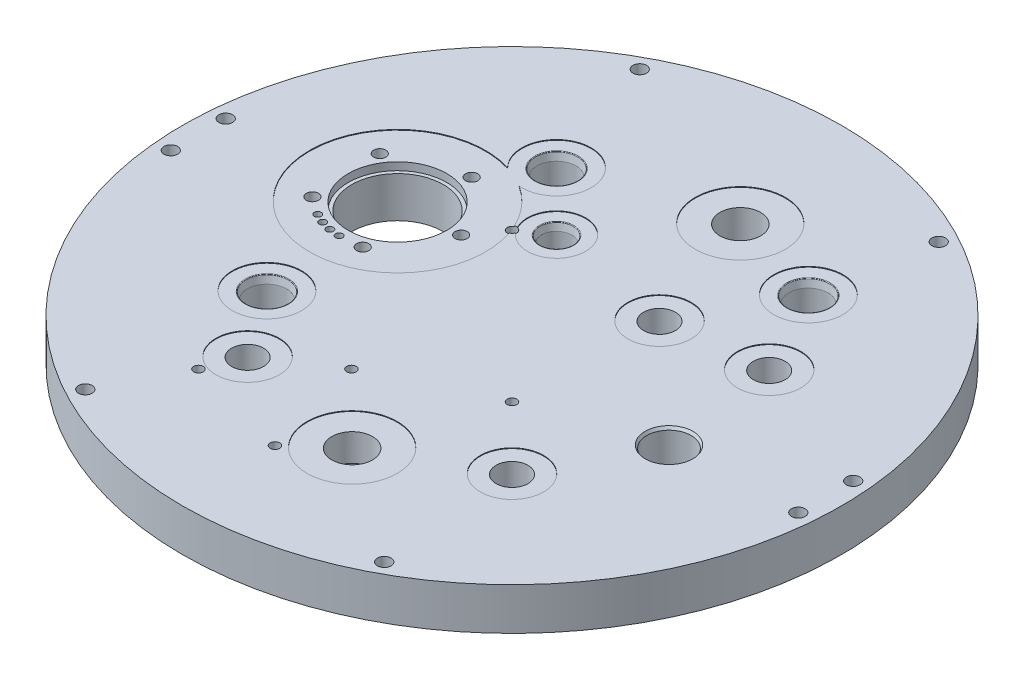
from build123d import *

# Parameters (mm, degrees)
CTD_PORT_D                                       = 33.02
CTD_PORT_CBORE_D                                 = 35.56
CTD_PORT_CBORE_DEPTH                             = 3.048
F_38_0_1015_DIAMETER_HOLE1_D                     = 2.54
F_17_0_173_DIAMETER_HOLE1_D                      = 4.3942
HOLE1_D                                          = 20
HOLE1_CBORE_D                                    = 63.5
HOLE1_CBORE_DEPTH                                = 0.254
F_8_32_TAPPED_HOLE2_D                            = 3.4544
F_8_32_TAPPED_HOLE2_DEPTH                        = 8.89
F_8_32_TAPPED_HOLE2_TIP                          = 1.037806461
F_4_40_TAPPED_HOLE1_D                            = 2.2606
F_4_40_TAPPED_HOLE1_DEPTH                        = 8.382
F_4_40_TAPPED_HOLE1_TIP                          = 0.679152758
F_4_40_TAPPED_HOLE2_D                            = 2.2606
F_4_40_TAPPED_HOLE2_DEPTH                        = 8.382
F_4_40_TAPPED_HOLE2_TIP                          = 0.679152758
F_8_32_TAPPED_HOLE3_D                            = 3.4544
F_8_32_TAPPED_HOLE3_DEPTH                        = 8.89
F_8_32_TAPPED_HOLE3_TIP                          = 1.037806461
THREAD_FOR_ANTENNA_PORT_D                        = 14.68374
ANTENNA_PORT_D                                   = 6.7564
ANTENNA_PORT_CBORE_D                             = 32.512
ANTENNA_PORT_CBORE_DEPTH                         = 0.254
CBORE_FOR_1_4_SOCKET_HEAD_CAP_SCREW2_D           = 6.7564
CBORE_FOR_1_4_SOCKET_HEAD_CAP_SCREW2_CBORE_D     = 28.575
CBORE_FOR_1_4_SOCKET_HEAD_CAP_SCREW2_CBORE_DEPTH = 7.62
SUBCONN_CBORES_D                                 = 11.50874
SUBCONN_CBORES_CBORE_D                           = 26.67
SUBCONN_CBORES_CBORE_DEPTH                       = 9.144
SUBCONN_PORTS_D                                  = 2.54
SUBCONN_PORTS_DEPTH                              = 25.4
SUBCONN_PORTS_CBORE_D                            = 22.86
SUBCONN_PORTS_CBORE_DEPTH                        = 0.254
F_8_32_TAPPED_HOLE5_D                            = 3.4544
F_8_32_TAPPED_HOLE5_DEPTH                        = 10.668
F_8_32_TAPPED_HOLE4_D                            = 3.4544
F_8_32_TAPPED_HOLE4_DEPTH                        = 10.668
F_10_0_1935_DIAMETER_HOLE1_D                     = 4.9149


with BuildPart() as part:
    # Sketch1 → Revolve1 (revolve)
    with BuildSketch(Plane.XY, mode=Mode.PRIVATE) as revolve1_sk:
        Polygon((0, 15.24), (-118.9355, 15.24), (-118.9355, 0), (-91.821, 0), (-91.821, -1.27), (-91.597064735, -2.54), (0, -2.54), align=None)
    revolve(revolve1_sk.sketch.rotate(Axis((0, 0, 0), (0, 1, 0)), 270), axis=Axis((0, 0, 0), (0, 1, 0)))

    # CTD Port (through all)
    with Locations(Plane(origin=(0, 15.24, 0), x_dir=(1, 0, 0), z_dir=(0, 1, 0))):
        with Locations((-56.429386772, 15.120208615)):
            CounterBoreHole(CTD_PORT_D / 2, CTD_PORT_CBORE_D / 2, CTD_PORT_CBORE_DEPTH)

    # 38 _0.1015_ Diameter Hole1 (through all)
    with Locations(Plane(origin=(0, 15.24, 0), x_dir=(1, 0, 0), z_dir=(0, 1, 0))):
        with Locations((-66.970386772, -3.137338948), (-63.639855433, -4.690391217), (-60.090237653, -5.641508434), (-56.429386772, -5.961791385)):
            Hole(F_38_0_1015_DIAMETER_HOLE1_D / 2)

    # 17 _0.173_ Diameter Hole1 (through all)
    with Locations(Plane(origin=(0, 15.24, 0), x_dir=(1, 0, 0), z_dir=(0, 1, 0))):
        with Locations((-50.775743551, 36.219892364), (-74.749306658, 27.017303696), (-73.405363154, 1.373333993), (-48.601197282, -5.272922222), (-34.615323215, 16.263435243)):
            Hole(F_17_0_173_DIAMETER_HOLE1_D / 2)

    # Hole1 (through all)
    with Locations(Plane(origin=(0, 15.24, 0), x_dir=(1, 0, 0), z_dir=(0, 1, 0))):
        with Locations((-56.429386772, 15.120208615)):
            CounterBoreHole(HOLE1_D / 2, HOLE1_CBORE_D / 2, HOLE1_CBORE_DEPTH)

    # Port Sketch1 → SAE Port1 (revolve, cut)
    with BuildSketch(Plane(origin=(-35.123411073, 15.24, -54.254578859), x_dir=(-1, 0, 0), z_dir=(0, 0, 1)), mode=Mode.PRIVATE) as sae_port1_sk:
        with BuildLine():
            Line((3.057319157, 54.988507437), (9.605439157, 51.054))
            Line((9.605439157, 51.054), (9.605439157, 12.954))
            Line((9.605439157, 12.954), (10.201069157, 12.954))
            Line((10.201069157, 12.954), (10.201069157, 2.880662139))
            Line((10.201069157, 2.880662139), (10.127731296, 2.954))
            Line((10.127731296, 2.954), (10.658869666, 0.455190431))
            ThreePointArc((10.658869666, 0.455190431), (10.747471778, 0.310604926), (10.907319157, 0.254))
            Line((10.907319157, 0.254), (15.557319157, 0.254))
            Line((15.557319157, 0.254), (15.557319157, 0))
            Line((15.557319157, 0), (3.057319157, 0))
            Line((3.057319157, 0), (3.057319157, 54.988507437))
        make_face()
    revolve(sae_port1_sk.sketch.rotate(Axis((-38.18073023, 15.24, -54.254578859), (0, -1, 0)), 270), axis=Axis((-38.18073023, 15.24, -54.254578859), (0, -1, 0)), mode=Mode.SUBTRACT)

    # Port Sketch2 → SAE Port2 (revolve, cut)
    with BuildSketch(Plane(origin=(-14.237697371, 15.24, -33.368865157), x_dir=(-1, 0, 0), z_dir=(0, 0, 1)), mode=Mode.PRIVATE) as sae_port2_sk:
        with BuildLine():
            Line((3.057319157, 54.034641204), (8.017939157, 51.054))
            Line((8.017939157, 51.054), (8.017939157, 11.754))
            Line((8.017939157, 11.754), (8.613569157, 11.754))
            Line((8.613569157, 11.754), (8.613569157, 2.764417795))
            Line((8.613569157, 2.764417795), (8.523986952, 2.854))
            Line((8.523986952, 2.854), (9.033869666, 0.455190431))
            ThreePointArc((9.033869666, 0.455190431), (9.122471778, 0.310604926), (9.282319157, 0.254))
            Line((9.282319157, 0.254), (13.557319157, 0.254))
            Line((13.557319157, 0.254), (13.557319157, 0))
            Line((13.557319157, 0), (3.057319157, 0))
            Line((3.057319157, 0), (3.057319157, 54.034641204))
        make_face()
    revolve(sae_port2_sk.sketch.rotate(Axis((-17.295016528, 15.24, -33.368865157), (0, -1, 0)), 270), axis=Axis((-17.295016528, 15.24, -33.368865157), (0, -1, 0)), mode=Mode.SUBTRACT)

    # Port Sketch → SAE Port (revolve, cut)
    with BuildSketch(Plane(origin=(-48.958835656, 15.24, 36.422103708), x_dir=(-1, 0, 0), z_dir=(0, 0, 1)), mode=Mode.PRIVATE) as sae_port_sk:
        with BuildLine():
            Line((3.057319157, 29.588507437), (9.605439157, 25.654))
            Line((9.605439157, 25.654), (9.605439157, 12.954))
            Line((9.605439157, 12.954), (10.201069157, 12.954))
            Line((10.201069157, 12.954), (10.201069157, 2.880662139))
            Line((10.201069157, 2.880662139), (10.127731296, 2.954))
            Line((10.127731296, 2.954), (10.658869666, 0.455190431))
            ThreePointArc((10.658869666, 0.455190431), (10.747471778, 0.310604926), (10.907319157, 0.254))
            Line((10.907319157, 0.254), (15.557319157, 0.254))
            Line((15.557319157, 0.254), (15.557319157, 0))
            Line((15.557319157, 0), (3.057319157, 0))
            Line((3.057319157, 0), (3.057319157, 29.588507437))
        make_face()
    revolve(sae_port_sk.sketch.rotate(Axis((-52.016154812, 15.24, 36.422103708), (0, -1, 0)), 270), axis=Axis((-52.016154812, 15.24, 36.422103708), (0, -1, 0)), mode=Mode.SUBTRACT)

    # 8-32 Tapped Hole2
    with Locations(Plane(origin=(0, -2.54, 0), x_dir=(-1, 0, 0), z_dir=(0, -1, 0))):
        with Locations((-0.174338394, -20.387804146), (20.32, 0), (0, -33.02), (33.02, 0), (0, 33.02), (-0.174338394, 20.387804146)):
            Hole(F_8_32_TAPPED_HOLE2_D / 2, depth=F_8_32_TAPPED_HOLE2_DEPTH)
            with Locations((0, 0, -(F_8_32_TAPPED_HOLE2_DEPTH + F_8_32_TAPPED_HOLE2_TIP / 2))):  # 118° drill point
                Cone(0, F_8_32_TAPPED_HOLE2_D / 2, F_8_32_TAPPED_HOLE2_TIP, mode=Mode.SUBTRACT)

    # Sketch41 → Optode Port (revolve, cut)
    with BuildSketch(Plane(origin=(68.788821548, -2.54, 12.12932521), x_dir=(0, 0, -1), z_dir=(1, 0, 0))):
        Polygon((0, 0), (0, 17.78), (8.606588, 17.78), (8.02, 16.763999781), (8.02, 5.08), (15.875, 5.08), (15.875, 0), align=None)
    revolve(axis=Axis((68.788821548, -8.89, 12.12932521), (0, 1, 0)), mode=Mode.SUBTRACT)

    # 4-40 Tapped Hole1
    with Locations(Plane(origin=(0, -2.54, 0), x_dir=(-1, 0, 0), z_dir=(0, -1, 0))):
        with Locations((60.996410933, -27.441847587)):
            Hole(F_4_40_TAPPED_HOLE1_D / 2, depth=F_4_40_TAPPED_HOLE1_DEPTH)
            with Locations((0, 0, -(F_4_40_TAPPED_HOLE1_DEPTH + F_4_40_TAPPED_HOLE1_TIP / 2))):  # 118° drill point
                Cone(0, F_4_40_TAPPED_HOLE1_D / 2, F_4_40_TAPPED_HOLE1_TIP, mode=Mode.SUBTRACT)

    # 4-40 Tapped Hole2
    with Locations(Plane(origin=(0, -2.54, 0), x_dir=(-1, 0, 0), z_dir=(0, -1, 0))):
        with Locations((-43.388821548, -12.12932521), (-94.188821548, -12.12932521)):
            Hole(F_4_40_TAPPED_HOLE2_D / 2, depth=F_4_40_TAPPED_HOLE2_DEPTH)
            with Locations((0, 0, -(F_4_40_TAPPED_HOLE2_DEPTH + F_4_40_TAPPED_HOLE2_TIP / 2))):  # 118° drill point
                Cone(0, F_4_40_TAPPED_HOLE2_D / 2, F_4_40_TAPPED_HOLE2_TIP, mode=Mode.SUBTRACT)

    # 8-32 Tapped Hole3
    with Locations(Plane(origin=(0, -2.54, 0), x_dir=(-1, 0, 0), z_dir=(0, -1, 0))):
        with Locations((40.411152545, 13.470384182), (13.470384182, 40.411152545), (-40.411152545, -13.470384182), (-13.470384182, -40.411152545)):
            Hole(F_8_32_TAPPED_HOLE3_D / 2, depth=F_8_32_TAPPED_HOLE3_DEPTH)
            with Locations((0, 0, -(F_8_32_TAPPED_HOLE3_DEPTH + F_8_32_TAPPED_HOLE3_TIP / 2))):  # 118° drill point
                Cone(0, F_8_32_TAPPED_HOLE3_D / 2, F_8_32_TAPPED_HOLE3_TIP, mode=Mode.SUBTRACT)

    # Thread For Antenna Port (through all)
    with Locations(Plane(origin=(0, 15.24, 0), x_dir=(1, 0, 0), z_dir=(0, 1, 0))):
        with Locations((12.349858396, -70.039527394)):
            thread_for_antenna_port = Hole(THREAD_FOR_ANTENNA_PORT_D / 2)

    # Antenna Port (through all)
    with Locations(Plane(origin=(0, 15.24, 0), x_dir=(1, 0, 0), z_dir=(0, 1, 0))):
        with Locations((12.349858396, -70.039527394)):
            antenna_port = CounterBoreHole(ANTENNA_PORT_D / 2, ANTENNA_PORT_CBORE_D / 2, ANTENNA_PORT_CBORE_DEPTH)

    # Mirror1: Thread For Antenna Port, Antenna Port across plane
    add(thread_for_antenna_port.mirror(Plane.XY), mode=Mode.SUBTRACT)
    add(antenna_port.mirror(Plane.XY), mode=Mode.SUBTRACT)

    # CBORE for 1_4 Socket Head Cap Screw2 (through all)
    with Locations(Plane(origin=(0, -2.54, 0), x_dir=(-1, 0, 0), z_dir=(0, -1, 0))):
        with Locations((-12.349858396, -70.039527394)):
            CounterBoreHole(CBORE_FOR_1_4_SOCKET_HEAD_CAP_SCREW2_D / 2, CBORE_FOR_1_4_SOCKET_HEAD_CAP_SCREW2_CBORE_D / 2, CBORE_FOR_1_4_SOCKET_HEAD_CAP_SCREW2_CBORE_DEPTH)

    # Subconn CBores (through all)
    with Locations(Plane(origin=(0, -2.54, 0), x_dir=(-1, 0, 0), z_dir=(0, -1, 0))):
        with Locations((-63.305598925, 29.519885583), (34.925, -60.491874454), (-49.391408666, -49.391408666), (-28.165098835, 25.067308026)):
            CounterBoreHole(SUBCONN_CBORES_D / 2, SUBCONN_CBORES_CBORE_D / 2, SUBCONN_CBORES_CBORE_DEPTH)

    # Subconn Ports
    with Locations(Plane(origin=(0, 15.24, 0), x_dir=(1, 0, 0), z_dir=(0, 1, 0))):
        with Locations((63.305598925, 29.519885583), (-34.925, -60.491874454), (28.165098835, 25.067308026), (49.391408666, -49.391408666)):
            CounterBoreHole(SUBCONN_PORTS_D / 2, SUBCONN_PORTS_CBORE_D / 2, SUBCONN_PORTS_CBORE_DEPTH, depth=SUBCONN_PORTS_DEPTH)

    # Port Sketch3 → SAE Port3 (revolve, cut)
    with BuildSketch(Plane(origin=(49.970723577, 15.24, -60.046419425), x_dir=(-1, 0, 0), z_dir=(0, 0, 1)), mode=Mode.PRIVATE) as sae_port3_sk:
        with BuildLine():
            Line((3.057319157, 29.588507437), (9.605439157, 25.654))
            Line((9.605439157, 25.654), (9.605439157, 12.954))
            Line((9.605439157, 12.954), (10.201069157, 12.954))
            Line((10.201069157, 12.954), (10.201069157, 2.880662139))
            Line((10.201069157, 2.880662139), (10.127731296, 2.954))
            Line((10.127731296, 2.954), (10.658869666, 0.455190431))
            ThreePointArc((10.658869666, 0.455190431), (10.747471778, 0.310604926), (10.907319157, 0.254))
            Line((10.907319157, 0.254), (15.557319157, 0.254))
            Line((15.557319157, 0.254), (15.557319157, 0))
            Line((15.557319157, 0), (3.057319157, 0))
            Line((3.057319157, 0), (3.057319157, 29.588507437))
        make_face()
    revolve(sae_port3_sk.sketch.rotate(Axis((46.91340442, 15.24, -60.046419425), (0, -1, 0)), 270), axis=Axis((46.91340442, 15.24, -60.046419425), (0, -1, 0)), mode=Mode.SUBTRACT)

    # 8-32 Tapped Hole5
    with Locations(Plane(origin=(0, 15.24, 0), x_dir=(1, 0, 0), z_dir=(0, 1, 0))):
        with Locations((26.940768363, -26.940768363), (-26.940768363, 26.940768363)):
            Hole(F_8_32_TAPPED_HOLE5_D / 2, depth=F_8_32_TAPPED_HOLE5_DEPTH)

    # 8-32 Tapped Hole4
    with Locations(Plane(origin=(0, 15.24, 0), x_dir=(1, 0, 0), z_dir=(0, 1, 0))):
        with Locations((-2.138555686, -83.409873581), (-39.85289324, -73.304347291), (-12.244081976, -45.695536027)):
            Hole(F_8_32_TAPPED_HOLE4_D / 2, depth=F_8_32_TAPPED_HOLE4_DEPTH)

    # 10 _0.1935_ Diameter Hole1 (through all)
    with Locations(Plane(origin=(0, 15.24, 0), x_dir=(1, 0, 0), z_dir=(0, 1, 0))):
        with Locations((113.232470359, -9.906557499), (113.232470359, 9.906557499), (53.945451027, 100.048091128), (-53.945451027, 100.048091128), (-113.232470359, 9.906557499), (-113.232470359, -9.906557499), (-53.945451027, -100.048091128), (53.945451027, -100.048091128)):
            Hole(F_10_0_1935_DIAMETER_HOLE1_D / 2)


solid = part.part
